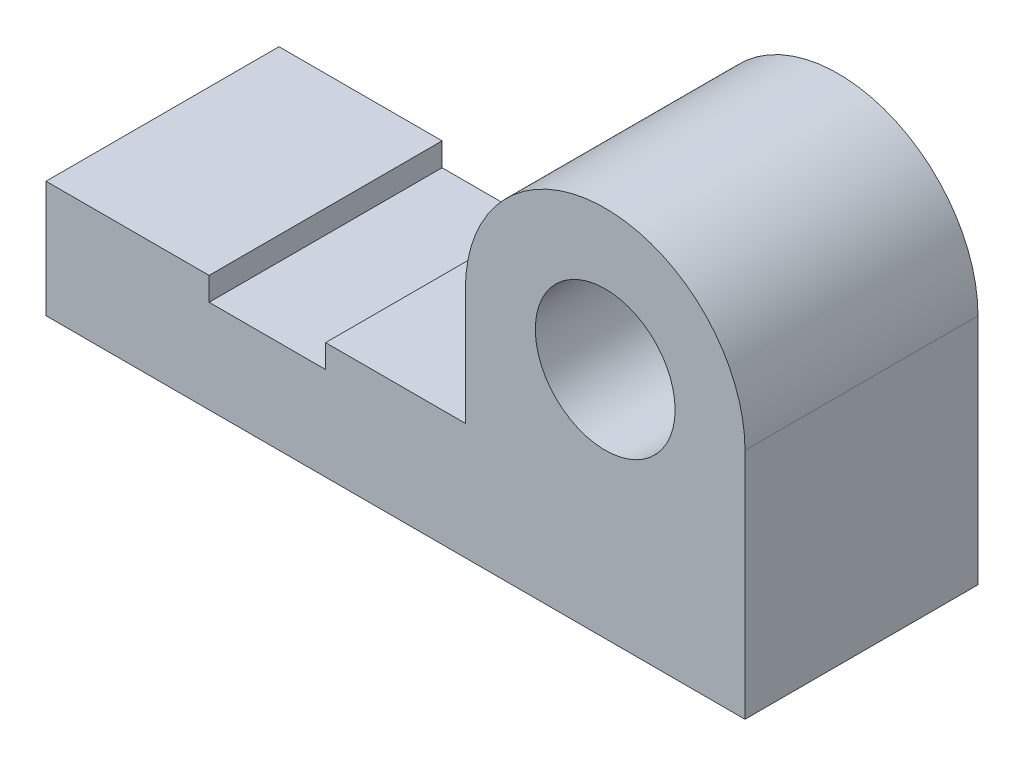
from build123d import *

# Parameters (mm, degrees)
SKETCH1_R           = 30
BOSS_EXTRUDE1_DEPTH = 100


with BuildPart() as part:
    # Sketch1 → Boss-Extrude1 (new body)
    with BuildSketch(Plane.XY):
        with BuildLine():
            Line((0, 0), (300, 0))
            Line((300, 0), (300, 100))
            ThreePointArc((300, 100), (240, 160), (180, 100))
            Line((180, 100), (180, 50))
            Line((180, 50), (120, 50))
            Line((120, 50), (120, 40))
            Line((120, 40), (70, 40))
            Line((70, 40), (70, 50))
            Line((70, 50), (0, 50))
            Line((0, 50), (0, 0))
        make_face()
        with Locations((240, 100)):
            Circle(SKETCH1_R, mode=Mode.SUBTRACT)
    extrude(amount=BOSS_EXTRUDE1_DEPTH)


solid = part.part
